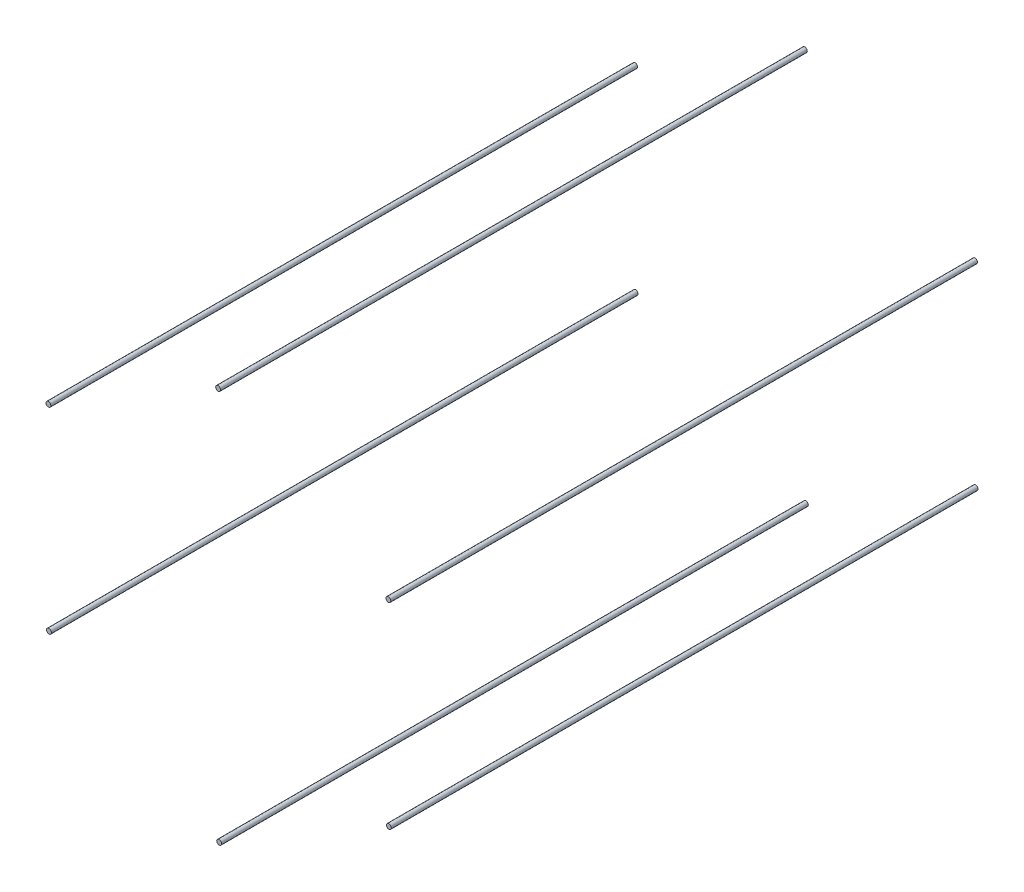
ISO-10303-21;
HEADER;
FILE_DESCRIPTION(('STEP AP214'),'2;1');
FILE_NAME('part.step','',(''),(''),'','','');
FILE_SCHEMA(('AUTOMOTIVE_DESIGN { 1 0 10303 214 1 1 1 1 }'));
ENDSEC;
DATA;
#1=APPLICATION_CONTEXT('core data for automotive mechanical design processes');
#2=APPLICATION_PROTOCOL_DEFINITION('international standard','automotive_design',2000,#1);
#3=PRODUCT_CONTEXT('',#1,'mechanical');
#4=PRODUCT('Part','Part','',(#3));
#5=PRODUCT_RELATED_PRODUCT_CATEGORY('part','',(#4));
#6=PRODUCT_DEFINITION_FORMATION('','',#4);
#7=PRODUCT_DEFINITION_CONTEXT('part definition',#1,'design');
#8=PRODUCT_DEFINITION('design','',#6,#7);
#9=PRODUCT_DEFINITION_SHAPE('','',#8);
#10=(LENGTH_UNIT() NAMED_UNIT(*) SI_UNIT(.MILLI.,.METRE.));
#11=(NAMED_UNIT(*) PLANE_ANGLE_UNIT() SI_UNIT($,.RADIAN.));
#12=(NAMED_UNIT(*) SI_UNIT($,.STERADIAN.) SOLID_ANGLE_UNIT());
#13=UNCERTAINTY_MEASURE_WITH_UNIT(LENGTH_MEASURE(1.E-05),#10,'distance_accuracy_value','');
#14=(GEOMETRIC_REPRESENTATION_CONTEXT(3) GLOBAL_UNCERTAINTY_ASSIGNED_CONTEXT((#13)) GLOBAL_UNIT_ASSIGNED_CONTEXT((#10,
#11,#12)) REPRESENTATION_CONTEXT('',''));
#15=CARTESIAN_POINT('',(0.,0.,0.));
#16=DIRECTION('',(0.,0.,1.));
#17=DIRECTION('',(1.,0.,0.));
#18=AXIS2_PLACEMENT_3D('',#15,#16,#17);
#19=CARTESIAN_POINT('',(-444.500000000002,255.073348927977,768.35));
#20=DIRECTION('',(0.,0.,-1.));
#21=DIRECTION('',(-1.,0.,0.));
#22=AXIS2_PLACEMENT_3D('',#19,#20,#21);
#23=CYLINDRICAL_SURFACE('',#22,6.34999999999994);
#24=CARTESIAN_POINT('',(-444.500000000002,255.073348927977,768.35));
#25=DIRECTION('',(0.,0.,1.));
#26=DIRECTION('',(1.,0.,0.));
#27=AXIS2_PLACEMENT_3D('',#24,#25,#26);
#28=CIRCLE('',#27,6.34999999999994);
#29=CARTESIAN_POINT('',(-438.150000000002,255.073348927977,768.35));
#30=VERTEX_POINT('',#29);
#31=EDGE_CURVE('E56',#30,#30,#28,.T.);
#32=ORIENTED_EDGE('',*,*,#31,.F.);
#33=EDGE_LOOP('',(#32));
#34=FACE_BOUND('',#33,.T.);
#35=CARTESIAN_POINT('',(-444.500000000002,255.073348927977,-768.35));
#36=DIRECTION('',(0.,0.,1.));
#37=DIRECTION('',(1.,0.,0.));
#38=AXIS2_PLACEMENT_3D('',#35,#36,#37);
#39=CIRCLE('',#38,6.34999999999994);
#40=CARTESIAN_POINT('',(-438.150000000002,255.073348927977,-768.35));
#41=VERTEX_POINT('',#40);
#42=EDGE_CURVE('E11',#41,#41,#39,.T.);
#43=ORIENTED_EDGE('',*,*,#42,.T.);
#44=EDGE_LOOP('',(#43));
#45=FACE_BOUND('',#44,.T.);
#46=ADVANCED_FACE('F52',(#34,#45),#23,.T.);
#47=CARTESIAN_POINT('',(-444.500000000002,255.073348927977,768.35));
#48=DIRECTION('',(0.,0.,1.));
#49=DIRECTION('',(1.,0.,0.));
#50=AXIS2_PLACEMENT_3D('',#47,#48,#49);
#51=PLANE('',#50);
#52=ORIENTED_EDGE('',*,*,#31,.T.);
#53=EDGE_LOOP('',(#52));
#54=FACE_BOUND('',#53,.T.);
#55=ADVANCED_FACE('F54',(#54),#51,.T.);
#56=CARTESIAN_POINT('',(-444.500000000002,255.073348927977,-768.35));
#57=DIRECTION('',(0.,0.,1.));
#58=DIRECTION('',(1.,0.,0.));
#59=AXIS2_PLACEMENT_3D('',#56,#57,#58);
#60=PLANE('',#59);
#61=ORIENTED_EDGE('',*,*,#42,.F.);
#62=EDGE_LOOP('',(#61));
#63=FACE_BOUND('',#62,.T.);
#64=ADVANCED_FACE('F71',(#63),#60,.F.);
#65=CLOSED_SHELL('',(#46,#55,#64));
#66=MANIFOLD_SOLID_BREP('B2',#65);
#67=CARTESIAN_POINT('',(-443.150000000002,-258.970463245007,768.35));
#68=DIRECTION('',(0.,0.,-1.));
#69=DIRECTION('',(-1.,0.,0.));
#70=AXIS2_PLACEMENT_3D('',#67,#68,#69);
#71=CYLINDRICAL_SURFACE('',#70,6.34999999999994);
#72=CARTESIAN_POINT('',(-443.150000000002,-258.970463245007,768.35));
#73=DIRECTION('',(0.,0.,1.));
#74=DIRECTION('',(1.,0.,0.));
#75=AXIS2_PLACEMENT_3D('',#72,#73,#74);
#76=CIRCLE('',#75,6.34999999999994);
#77=CARTESIAN_POINT('',(-436.800000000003,-258.970463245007,768.35));
#78=VERTEX_POINT('',#77);
#79=EDGE_CURVE('E105',#78,#78,#76,.T.);
#80=ORIENTED_EDGE('',*,*,#79,.F.);
#81=EDGE_LOOP('',(#80));
#82=FACE_BOUND('',#81,.T.);
#83=CARTESIAN_POINT('',(-443.150000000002,-258.970463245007,-768.35));
#84=DIRECTION('',(0.,0.,1.));
#85=DIRECTION('',(1.,0.,0.));
#86=AXIS2_PLACEMENT_3D('',#83,#84,#85);
#87=CIRCLE('',#86,6.34999999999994);
#88=CARTESIAN_POINT('',(-436.800000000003,-258.970463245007,-768.35));
#89=VERTEX_POINT('',#88);
#90=EDGE_CURVE('E51',#89,#89,#87,.T.);
#91=ORIENTED_EDGE('',*,*,#90,.T.);
#92=EDGE_LOOP('',(#91));
#93=FACE_BOUND('',#92,.T.);
#94=ADVANCED_FACE('F101',(#82,#93),#71,.T.);
#95=CARTESIAN_POINT('',(-443.150000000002,-258.970463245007,768.35));
#96=DIRECTION('',(0.,0.,1.));
#97=DIRECTION('',(1.,0.,0.));
#98=AXIS2_PLACEMENT_3D('',#95,#96,#97);
#99=PLANE('',#98);
#100=ORIENTED_EDGE('',*,*,#79,.T.);
#101=EDGE_LOOP('',(#100));
#102=FACE_BOUND('',#101,.T.);
#103=ADVANCED_FACE('F103',(#102),#99,.T.);
#104=CARTESIAN_POINT('',(-443.150000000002,-258.970463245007,-768.35));
#105=DIRECTION('',(0.,0.,1.));
#106=DIRECTION('',(1.,0.,0.));
#107=AXIS2_PLACEMENT_3D('',#104,#105,#106);
#108=PLANE('',#107);
#109=ORIENTED_EDGE('',*,*,#90,.F.);
#110=EDGE_LOOP('',(#109));
#111=FACE_BOUND('',#110,.T.);
#112=ADVANCED_FACE('F120',(#111),#108,.F.);
#113=CLOSED_SHELL('',(#94,#103,#112));
#114=MANIFOLD_SOLID_BREP('B6',#113);
#115=CARTESIAN_POINT('',(2.69999999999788,-514.823235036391,768.35));
#116=DIRECTION('',(0.,0.,-1.));
#117=DIRECTION('',(-1.,0.,0.));
#118=AXIS2_PLACEMENT_3D('',#115,#116,#117);
#119=CYLINDRICAL_SURFACE('',#118,6.34999999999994);
#120=CARTESIAN_POINT('',(2.69999999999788,-514.823235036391,768.35));
#121=DIRECTION('',(0.,0.,1.));
#122=DIRECTION('',(1.,0.,0.));
#123=AXIS2_PLACEMENT_3D('',#120,#121,#122);
#124=CIRCLE('',#123,6.34999999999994);
#125=CARTESIAN_POINT('',(9.04999999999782,-514.823235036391,768.35));
#126=VERTEX_POINT('',#125);
#127=EDGE_CURVE('E154',#126,#126,#124,.T.);
#128=ORIENTED_EDGE('',*,*,#127,.F.);
#129=EDGE_LOOP('',(#128));
#130=FACE_BOUND('',#129,.T.);
#131=CARTESIAN_POINT('',(2.69999999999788,-514.823235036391,-768.35));
#132=DIRECTION('',(0.,0.,1.));
#133=DIRECTION('',(1.,0.,0.));
#134=AXIS2_PLACEMENT_3D('',#131,#132,#133);
#135=CIRCLE('',#134,6.34999999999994);
#136=CARTESIAN_POINT('',(9.04999999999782,-514.823235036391,-768.35));
#137=VERTEX_POINT('',#136);
#138=EDGE_CURVE('E100',#137,#137,#135,.T.);
#139=ORIENTED_EDGE('',*,*,#138,.T.);
#140=EDGE_LOOP('',(#139));
#141=FACE_BOUND('',#140,.T.);
#142=ADVANCED_FACE('F150',(#130,#141),#119,.T.);
#143=CARTESIAN_POINT('',(2.69999999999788,-514.823235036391,768.35));
#144=DIRECTION('',(0.,0.,1.));
#145=DIRECTION('',(1.,0.,0.));
#146=AXIS2_PLACEMENT_3D('',#143,#144,#145);
#147=PLANE('',#146);
#148=ORIENTED_EDGE('',*,*,#127,.T.);
#149=EDGE_LOOP('',(#148));
#150=FACE_BOUND('',#149,.T.);
#151=ADVANCED_FACE('F152',(#150),#147,.T.);
#152=CARTESIAN_POINT('',(2.69999999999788,-514.823235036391,-768.35));
#153=DIRECTION('',(0.,0.,1.));
#154=DIRECTION('',(1.,0.,0.));
#155=AXIS2_PLACEMENT_3D('',#152,#153,#154);
#156=PLANE('',#155);
#157=ORIENTED_EDGE('',*,*,#138,.F.);
#158=EDGE_LOOP('',(#157));
#159=FACE_BOUND('',#158,.T.);
#160=ADVANCED_FACE('F169',(#159),#156,.F.);
#161=CLOSED_SHELL('',(#142,#151,#160));
#162=MANIFOLD_SOLID_BREP('B46',#161);
#163=CARTESIAN_POINT('',(447.199999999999,-256.632194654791,768.35));
#164=DIRECTION('',(0.,0.,-1.));
#165=DIRECTION('',(-1.,0.,0.));
#166=AXIS2_PLACEMENT_3D('',#163,#164,#165);
#167=CYLINDRICAL_SURFACE('',#166,6.34999999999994);
#168=CARTESIAN_POINT('',(447.199999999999,-256.632194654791,768.35));
#169=DIRECTION('',(0.,0.,1.));
#170=DIRECTION('',(1.,0.,0.));
#171=AXIS2_PLACEMENT_3D('',#168,#169,#170);
#172=CIRCLE('',#171,6.34999999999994);
#173=CARTESIAN_POINT('',(453.549999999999,-256.632194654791,768.35));
#174=VERTEX_POINT('',#173);
#175=EDGE_CURVE('E203',#174,#174,#172,.T.);
#176=ORIENTED_EDGE('',*,*,#175,.F.);
#177=EDGE_LOOP('',(#176));
#178=FACE_BOUND('',#177,.T.);
#179=CARTESIAN_POINT('',(447.199999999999,-256.632194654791,-768.35));
#180=DIRECTION('',(0.,0.,1.));
#181=DIRECTION('',(1.,0.,0.));
#182=AXIS2_PLACEMENT_3D('',#179,#180,#181);
#183=CIRCLE('',#182,6.34999999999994);
#184=CARTESIAN_POINT('',(453.549999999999,-256.632194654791,-768.35));
#185=VERTEX_POINT('',#184);
#186=EDGE_CURVE('E149',#185,#185,#183,.T.);
#187=ORIENTED_EDGE('',*,*,#186,.T.);
#188=EDGE_LOOP('',(#187));
#189=FACE_BOUND('',#188,.T.);
#190=ADVANCED_FACE('F199',(#178,#189),#167,.T.);
#191=CARTESIAN_POINT('',(447.199999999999,-256.632194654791,768.35));
#192=DIRECTION('',(0.,0.,1.));
#193=DIRECTION('',(1.,0.,0.));
#194=AXIS2_PLACEMENT_3D('',#191,#192,#193);
#195=PLANE('',#194);
#196=ORIENTED_EDGE('',*,*,#175,.T.);
#197=EDGE_LOOP('',(#196));
#198=FACE_BOUND('',#197,.T.);
#199=ADVANCED_FACE('F201',(#198),#195,.T.);
#200=CARTESIAN_POINT('',(447.199999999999,-256.632194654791,-768.35));
#201=DIRECTION('',(0.,0.,1.));
#202=DIRECTION('',(1.,0.,0.));
#203=AXIS2_PLACEMENT_3D('',#200,#201,#202);
#204=PLANE('',#203);
#205=ORIENTED_EDGE('',*,*,#186,.F.);
#206=EDGE_LOOP('',(#205));
#207=FACE_BOUND('',#206,.T.);
#208=ADVANCED_FACE('F218',(#207),#204,.F.);
#209=CLOSED_SHELL('',(#190,#199,#208));
#210=MANIFOLD_SOLID_BREP('B95',#209);
#211=CARTESIAN_POINT('',(445.85,257.411617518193,768.35));
#212=DIRECTION('',(0.,0.,-1.));
#213=DIRECTION('',(-1.,0.,0.));
#214=AXIS2_PLACEMENT_3D('',#211,#212,#213);
#215=CYLINDRICAL_SURFACE('',#214,6.34999999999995);
#216=CARTESIAN_POINT('',(445.85,257.411617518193,768.35));
#217=DIRECTION('',(0.,0.,1.));
#218=DIRECTION('',(1.,0.,0.));
#219=AXIS2_PLACEMENT_3D('',#216,#217,#218);
#220=CIRCLE('',#219,6.34999999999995);
#221=CARTESIAN_POINT('',(452.2,257.411617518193,768.35));
#222=VERTEX_POINT('',#221);
#223=EDGE_CURVE('E251',#222,#222,#220,.T.);
#224=ORIENTED_EDGE('',*,*,#223,.F.);
#225=EDGE_LOOP('',(#224));
#226=FACE_BOUND('',#225,.T.);
#227=CARTESIAN_POINT('',(445.85,257.411617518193,-768.35));
#228=DIRECTION('',(0.,0.,1.));
#229=DIRECTION('',(1.,0.,0.));
#230=AXIS2_PLACEMENT_3D('',#227,#228,#229);
#231=CIRCLE('',#230,6.34999999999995);
#232=CARTESIAN_POINT('',(452.2,257.411617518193,-768.35));
#233=VERTEX_POINT('',#232);
#234=EDGE_CURVE('E198',#233,#233,#231,.T.);
#235=ORIENTED_EDGE('',*,*,#234,.T.);
#236=EDGE_LOOP('',(#235));
#237=FACE_BOUND('',#236,.T.);
#238=ADVANCED_FACE('F247',(#226,#237),#215,.T.);
#239=CARTESIAN_POINT('',(445.85,257.411617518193,768.35));
#240=DIRECTION('',(0.,0.,1.));
#241=DIRECTION('',(1.,0.,0.));
#242=AXIS2_PLACEMENT_3D('',#239,#240,#241);
#243=PLANE('',#242);
#244=ORIENTED_EDGE('',*,*,#223,.T.);
#245=EDGE_LOOP('',(#244));
#246=FACE_BOUND('',#245,.T.);
#247=ADVANCED_FACE('F249',(#246),#243,.T.);
#248=CARTESIAN_POINT('',(445.85,257.411617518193,-768.35));
#249=DIRECTION('',(0.,0.,1.));
#250=DIRECTION('',(1.,0.,0.));
#251=AXIS2_PLACEMENT_3D('',#248,#249,#250);
#252=PLANE('',#251);
#253=ORIENTED_EDGE('',*,*,#234,.F.);
#254=EDGE_LOOP('',(#253));
#255=FACE_BOUND('',#254,.T.);
#256=ADVANCED_FACE('F268',(#255),#252,.F.);
#257=CLOSED_SHELL('',(#238,#247,#256));
#258=MANIFOLD_SOLID_BREP('B144',#257);
#259=CARTESIAN_POINT('',(0.,513.264389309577,768.35));
#260=DIRECTION('',(0.,0.,-1.));
#261=DIRECTION('',(-1.,0.,0.));
#262=AXIS2_PLACEMENT_3D('',#259,#260,#261);
#263=CYLINDRICAL_SURFACE('',#262,6.34999999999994);
#264=CARTESIAN_POINT('',(0.,513.264389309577,768.35));
#265=DIRECTION('',(0.,0.,1.));
#266=DIRECTION('',(1.,0.,0.));
#267=AXIS2_PLACEMENT_3D('',#264,#265,#266);
#268=CIRCLE('',#267,6.34999999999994);
#269=CARTESIAN_POINT('',(6.34999999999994,513.264389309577,768.35));
#270=VERTEX_POINT('',#269);
#271=EDGE_CURVE('E246',#270,#270,#268,.T.);
#272=ORIENTED_EDGE('',*,*,#271,.F.);
#273=EDGE_LOOP('',(#272));
#274=FACE_BOUND('',#273,.T.);
#275=CARTESIAN_POINT('',(0.,513.264389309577,-768.35));
#276=DIRECTION('',(0.,0.,1.));
#277=DIRECTION('',(1.,0.,0.));
#278=AXIS2_PLACEMENT_3D('',#275,#276,#277);
#279=CIRCLE('',#278,6.34999999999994);
#280=CARTESIAN_POINT('',(6.34999999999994,513.264389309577,-768.35));
#281=VERTEX_POINT('',#280);
#282=EDGE_CURVE('E293',#281,#281,#279,.T.);
#283=ORIENTED_EDGE('',*,*,#282,.T.);
#284=EDGE_LOOP('',(#283));
#285=FACE_BOUND('',#284,.T.);
#286=ADVANCED_FACE('F290',(#274,#285),#263,.T.);
#287=CARTESIAN_POINT('',(0.,513.264389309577,768.35));
#288=DIRECTION('',(0.,0.,1.));
#289=DIRECTION('',(1.,0.,0.));
#290=AXIS2_PLACEMENT_3D('',#287,#288,#289);
#291=PLANE('',#290);
#292=ORIENTED_EDGE('',*,*,#271,.T.);
#293=EDGE_LOOP('',(#292));
#294=FACE_BOUND('',#293,.T.);
#295=ADVANCED_FACE('F305',(#294),#291,.T.);
#296=CARTESIAN_POINT('',(0.,513.264389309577,-768.35));
#297=DIRECTION('',(0.,0.,1.));
#298=DIRECTION('',(1.,0.,0.));
#299=AXIS2_PLACEMENT_3D('',#296,#297,#298);
#300=PLANE('',#299);
#301=ORIENTED_EDGE('',*,*,#282,.F.);
#302=EDGE_LOOP('',(#301));
#303=FACE_BOUND('',#302,.T.);
#304=ADVANCED_FACE('F303',(#303),#300,.F.);
#305=CLOSED_SHELL('',(#286,#295,#304));
#306=MANIFOLD_SOLID_BREP('B193',#305);
#307=ADVANCED_BREP_SHAPE_REPRESENTATION('',(#18,#66,#114,#162,#210,#258,#306),#14);
#308=SHAPE_DEFINITION_REPRESENTATION(#9,#307);
ENDSEC;
END-ISO-10303-21;
